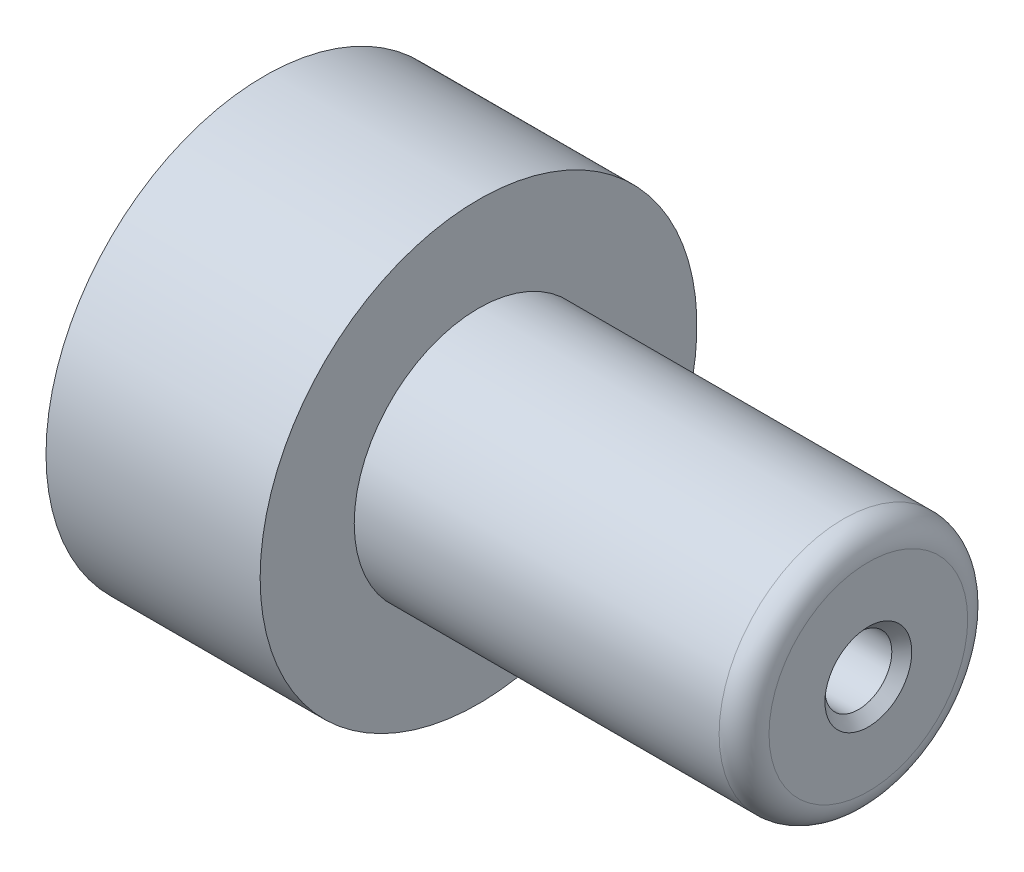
ISO-10303-21;
HEADER;
FILE_DESCRIPTION(('STEP AP214'),'2;1');
FILE_NAME('part.step','',(''),(''),'','','');
FILE_SCHEMA(('AUTOMOTIVE_DESIGN { 1 0 10303 214 1 1 1 1 }'));
ENDSEC;
DATA;
#1=APPLICATION_CONTEXT('core data for automotive mechanical design processes');
#2=APPLICATION_PROTOCOL_DEFINITION('international standard','automotive_design',2000,#1);
#3=PRODUCT_CONTEXT('',#1,'mechanical');
#4=PRODUCT('Part','Part','',(#3));
#5=PRODUCT_RELATED_PRODUCT_CATEGORY('part','',(#4));
#6=PRODUCT_DEFINITION_FORMATION('','',#4);
#7=PRODUCT_DEFINITION_CONTEXT('part definition',#1,'design');
#8=PRODUCT_DEFINITION('design','',#6,#7);
#9=PRODUCT_DEFINITION_SHAPE('','',#8);
#10=(LENGTH_UNIT() NAMED_UNIT(*) SI_UNIT(.MILLI.,.METRE.));
#11=(NAMED_UNIT(*) PLANE_ANGLE_UNIT() SI_UNIT($,.RADIAN.));
#12=(NAMED_UNIT(*) SI_UNIT($,.STERADIAN.) SOLID_ANGLE_UNIT());
#13=UNCERTAINTY_MEASURE_WITH_UNIT(LENGTH_MEASURE(1.E-05),#10,'distance_accuracy_value','');
#14=(GEOMETRIC_REPRESENTATION_CONTEXT(3) GLOBAL_UNCERTAINTY_ASSIGNED_CONTEXT((#13)) GLOBAL_UNIT_ASSIGNED_CONTEXT((#10,
#11,#12)) REPRESENTATION_CONTEXT('',''));
#15=CARTESIAN_POINT('',(0.,0.,0.));
#16=DIRECTION('',(0.,0.,1.));
#17=DIRECTION('',(1.,0.,0.));
#18=AXIS2_PLACEMENT_3D('',#15,#16,#17);
#19=CARTESIAN_POINT('',(0.,0.,0.));
#20=DIRECTION('',(-1.,0.,0.));
#21=DIRECTION('',(0.,0.,1.));
#22=AXIS2_PLACEMENT_3D('',#19,#20,#21);
#23=CYLINDRICAL_SURFACE('',#22,3.9751);
#24=CARTESIAN_POINT('',(21.8948,0.,0.));
#25=DIRECTION('',(-1.,0.,0.));
#26=DIRECTION('',(0.,0.,1.));
#27=AXIS2_PLACEMENT_3D('',#24,#25,#26);
#28=CIRCLE('',#27,3.9751);
#29=CARTESIAN_POINT('',(21.8948,0.,3.9751));
#30=VERTEX_POINT('',#29);
#31=EDGE_CURVE('E44',#30,#30,#28,.T.);
#32=ORIENTED_EDGE('',*,*,#31,.F.);
#33=EDGE_LOOP('',(#32));
#34=FACE_BOUND('',#33,.T.);
#35=CARTESIAN_POINT('',(0.,0.,0.));
#36=DIRECTION('',(-1.,0.,0.));
#37=DIRECTION('',(0.,0.,1.));
#38=AXIS2_PLACEMENT_3D('',#35,#36,#37);
#39=CIRCLE('',#38,3.9751);
#40=CARTESIAN_POINT('',(0.,0.,3.9751));
#41=VERTEX_POINT('',#40);
#42=EDGE_CURVE('E65',#41,#41,#39,.T.);
#43=ORIENTED_EDGE('',*,*,#42,.T.);
#44=EDGE_LOOP('',(#43));
#45=FACE_BOUND('',#44,.T.);
#46=ADVANCED_FACE('F33',(#34,#45),#23,.F.);
#47=CARTESIAN_POINT('',(21.8948,3.9751,0.));
#48=DIRECTION('',(1.,0.,0.));
#49=DIRECTION('',(0.,0.,-1.));
#50=AXIS2_PLACEMENT_3D('',#47,#48,#49);
#51=PLANE('',#50);
#52=CARTESIAN_POINT('',(21.8948,0.,0.));
#53=DIRECTION('',(1.,0.,0.));
#54=DIRECTION('',(0.,0.,-1.));
#55=AXIS2_PLACEMENT_3D('',#52,#53,#54);
#56=CIRCLE('',#55,1.7018);
#57=CARTESIAN_POINT('',(21.8948,0.,-1.7018));
#58=VERTEX_POINT('',#57);
#59=EDGE_CURVE('E78',#58,#58,#56,.T.);
#60=ORIENTED_EDGE('',*,*,#59,.T.);
#61=EDGE_LOOP('',(#60));
#62=FACE_BOUND('',#61,.T.);
#63=ORIENTED_EDGE('',*,*,#31,.T.);
#64=EDGE_LOOP('',(#63));
#65=FACE_BOUND('',#64,.T.);
#66=ADVANCED_FACE('F84',(#62,#65),#51,.F.);
#67=CARTESIAN_POINT('',(30.734,5.0546,0.));
#68=DIRECTION('',(-1.,0.,0.));
#69=DIRECTION('',(0.,0.,1.));
#70=AXIS2_PLACEMENT_3D('',#67,#68,#69);
#71=PLANE('',#70);
#72=CARTESIAN_POINT('',(30.734,0.,0.));
#73=DIRECTION('',(-1.,0.,0.));
#74=DIRECTION('',(0.,0.,1.));
#75=AXIS2_PLACEMENT_3D('',#72,#73,#74);
#76=CIRCLE('',#75,2.2098);
#77=CARTESIAN_POINT('',(30.734,0.,2.2098));
#78=VERTEX_POINT('',#77);
#79=EDGE_CURVE('E10',#78,#78,#76,.T.);
#80=ORIENTED_EDGE('',*,*,#79,.T.);
#81=EDGE_LOOP('',(#80));
#82=FACE_BOUND('',#81,.T.);
#83=CARTESIAN_POINT('',(30.734,0.,0.));
#84=DIRECTION('',(-1.,0.,0.));
#85=DIRECTION('',(0.,0.,1.));
#86=AXIS2_PLACEMENT_3D('',#83,#84,#85);
#87=CIRCLE('',#86,5.0546);
#88=CARTESIAN_POINT('',(30.734,0.,5.0546));
#89=VERTEX_POINT('',#88);
#90=EDGE_CURVE('E48',#89,#89,#87,.T.);
#91=ORIENTED_EDGE('',*,*,#90,.F.);
#92=EDGE_LOOP('',(#91));
#93=FACE_BOUND('',#92,.T.);
#94=ADVANCED_FACE('F104',(#82,#93),#71,.F.);
#95=CARTESIAN_POINT('',(29.464,0.,0.));
#96=DIRECTION('',(-1.,0.,0.));
#97=DIRECTION('',(0.,0.,1.));
#98=AXIS2_PLACEMENT_3D('',#95,#96,#97);
#99=TOROIDAL_SURFACE('',#98,5.0546,1.27);
#100=CARTESIAN_POINT('',(29.464,0.,0.));
#101=DIRECTION('',(-1.,0.,0.));
#102=DIRECTION('',(0.,0.,1.));
#103=AXIS2_PLACEMENT_3D('',#100,#101,#102);
#104=CIRCLE('',#103,6.3246);
#105=CARTESIAN_POINT('',(29.464,0.,6.3246));
#106=VERTEX_POINT('',#105);
#107=EDGE_CURVE('E53',#106,#106,#104,.T.);
#108=ORIENTED_EDGE('',*,*,#107,.F.);
#109=EDGE_LOOP('',(#108));
#110=FACE_BOUND('',#109,.T.);
#111=ORIENTED_EDGE('',*,*,#90,.T.);
#112=EDGE_LOOP('',(#111));
#113=FACE_BOUND('',#112,.T.);
#114=ADVANCED_FACE('F111',(#110,#113),#99,.T.);
#115=CARTESIAN_POINT('',(0.,0.,0.));
#116=DIRECTION('',(-1.,0.,0.));
#117=DIRECTION('',(0.,0.,1.));
#118=AXIS2_PLACEMENT_3D('',#115,#116,#117);
#119=CYLINDRICAL_SURFACE('',#118,6.3246);
#120=CARTESIAN_POINT('',(10.8966,0.,0.));
#121=DIRECTION('',(-1.,0.,0.));
#122=DIRECTION('',(0.,0.,1.));
#123=AXIS2_PLACEMENT_3D('',#120,#121,#122);
#124=CIRCLE('',#123,6.3246);
#125=CARTESIAN_POINT('',(10.8966,0.,6.3246));
#126=VERTEX_POINT('',#125);
#127=EDGE_CURVE('E56',#126,#126,#124,.T.);
#128=ORIENTED_EDGE('',*,*,#127,.F.);
#129=EDGE_LOOP('',(#128));
#130=FACE_BOUND('',#129,.T.);
#131=ORIENTED_EDGE('',*,*,#107,.T.);
#132=EDGE_LOOP('',(#131));
#133=FACE_BOUND('',#132,.T.);
#134=ADVANCED_FACE('F114',(#130,#133),#119,.T.);
#135=CARTESIAN_POINT('',(10.8966,11.1125,0.));
#136=DIRECTION('',(-1.,0.,0.));
#137=DIRECTION('',(0.,0.,1.));
#138=AXIS2_PLACEMENT_3D('',#135,#136,#137);
#139=PLANE('',#138);
#140=CARTESIAN_POINT('',(10.8966,0.,0.));
#141=DIRECTION('',(-1.,0.,0.));
#142=DIRECTION('',(0.,0.,1.));
#143=AXIS2_PLACEMENT_3D('',#140,#141,#142);
#144=CIRCLE('',#143,11.1125);
#145=CARTESIAN_POINT('',(10.8966,0.,11.1125));
#146=VERTEX_POINT('',#145);
#147=EDGE_CURVE('E59',#146,#146,#144,.T.);
#148=ORIENTED_EDGE('',*,*,#147,.F.);
#149=EDGE_LOOP('',(#148));
#150=FACE_BOUND('',#149,.T.);
#151=ORIENTED_EDGE('',*,*,#127,.T.);
#152=EDGE_LOOP('',(#151));
#153=FACE_BOUND('',#152,.T.);
#154=ADVANCED_FACE('F118',(#150,#153),#139,.F.);
#155=CARTESIAN_POINT('',(0.,0.,0.));
#156=DIRECTION('',(-1.,0.,0.));
#157=DIRECTION('',(0.,0.,1.));
#158=AXIS2_PLACEMENT_3D('',#155,#156,#157);
#159=CYLINDRICAL_SURFACE('',#158,11.1125);
#160=CARTESIAN_POINT('',(0.,0.,0.));
#161=DIRECTION('',(-1.,0.,0.));
#162=DIRECTION('',(0.,0.,1.));
#163=AXIS2_PLACEMENT_3D('',#160,#161,#162);
#164=CIRCLE('',#163,11.1125);
#165=CARTESIAN_POINT('',(0.,0.,11.1125));
#166=VERTEX_POINT('',#165);
#167=EDGE_CURVE('E62',#166,#166,#164,.T.);
#168=ORIENTED_EDGE('',*,*,#167,.F.);
#169=EDGE_LOOP('',(#168));
#170=FACE_BOUND('',#169,.T.);
#171=ORIENTED_EDGE('',*,*,#147,.T.);
#172=EDGE_LOOP('',(#171));
#173=FACE_BOUND('',#172,.T.);
#174=ADVANCED_FACE('F122',(#170,#173),#159,.T.);
#175=CARTESIAN_POINT('',(0.,3.9751,0.));
#176=DIRECTION('',(1.,0.,0.));
#177=DIRECTION('',(0.,0.,-1.));
#178=AXIS2_PLACEMENT_3D('',#175,#176,#177);
#179=PLANE('',#178);
#180=CARTESIAN_POINT('',(0.,0.,6.7437));
#181=DIRECTION('',(-1.,0.,0.));
#182=DIRECTION('',(0.,0.,-1.));
#183=AXIS2_PLACEMENT_3D('',#180,#181,#182);
#184=CIRCLE('',#183,1.2065);
#185=CARTESIAN_POINT('',(0.,0.,5.5372));
#186=VERTEX_POINT('',#185);
#187=EDGE_CURVE('E75',#186,#186,#184,.T.);
#188=ORIENTED_EDGE('',*,*,#187,.F.);
#189=EDGE_LOOP('',(#188));
#190=FACE_BOUND('',#189,.T.);
#191=CARTESIAN_POINT('',(0.,0.,-6.7437));
#192=DIRECTION('',(-1.,0.,0.));
#193=DIRECTION('',(0.,0.,1.));
#194=AXIS2_PLACEMENT_3D('',#191,#192,#193);
#195=CIRCLE('',#194,1.2065);
#196=CARTESIAN_POINT('',(0.,0.,-5.5372));
#197=VERTEX_POINT('',#196);
#198=EDGE_CURVE('E69',#197,#197,#195,.T.);
#199=ORIENTED_EDGE('',*,*,#198,.F.);
#200=EDGE_LOOP('',(#199));
#201=FACE_BOUND('',#200,.T.);
#202=ORIENTED_EDGE('',*,*,#42,.F.);
#203=EDGE_LOOP('',(#202));
#204=FACE_BOUND('',#203,.T.);
#205=ORIENTED_EDGE('',*,*,#167,.T.);
#206=EDGE_LOOP('',(#205));
#207=FACE_BOUND('',#206,.T.);
#208=ADVANCED_FACE('F126',(#190,#201,#204,#207),#179,.F.);
#209=CARTESIAN_POINT('',(2.54,0.,-6.7437));
#210=DIRECTION('',(-1.,0.,0.));
#211=DIRECTION('',(0.,0.,1.));
#212=AXIS2_PLACEMENT_3D('',#209,#210,#211);
#213=CYLINDRICAL_SURFACE('',#212,1.2065);
#214=CARTESIAN_POINT('',(2.54,0.,-6.7437));
#215=DIRECTION('',(-1.,0.,0.));
#216=DIRECTION('',(0.,0.,1.));
#217=AXIS2_PLACEMENT_3D('',#214,#215,#216);
#218=CIRCLE('',#217,1.2065);
#219=CARTESIAN_POINT('',(2.54,0.,-5.5372));
#220=VERTEX_POINT('',#219);
#221=EDGE_CURVE('E68',#220,#220,#218,.T.);
#222=ORIENTED_EDGE('',*,*,#221,.F.);
#223=EDGE_LOOP('',(#222));
#224=FACE_BOUND('',#223,.T.);
#225=ORIENTED_EDGE('',*,*,#198,.T.);
#226=EDGE_LOOP('',(#225));
#227=FACE_BOUND('',#226,.T.);
#228=ADVANCED_FACE('F130',(#224,#227),#213,.F.);
#229=CARTESIAN_POINT('',(2.54,0.,-6.7437));
#230=DIRECTION('',(-1.,0.,0.));
#231=DIRECTION('',(0.,0.,1.));
#232=AXIS2_PLACEMENT_3D('',#229,#230,#231);
#233=PLANE('',#232);
#234=ORIENTED_EDGE('',*,*,#221,.T.);
#235=EDGE_LOOP('',(#234));
#236=FACE_BOUND('',#235,.T.);
#237=ADVANCED_FACE('F134',(#236),#233,.T.);
#238=CARTESIAN_POINT('',(2.54,0.,6.7437));
#239=DIRECTION('',(-1.,0.,0.));
#240=DIRECTION('',(0.,0.,1.));
#241=AXIS2_PLACEMENT_3D('',#238,#239,#240);
#242=CYLINDRICAL_SURFACE('',#241,1.2065);
#243=CARTESIAN_POINT('',(2.54,0.,6.7437));
#244=DIRECTION('',(-1.,0.,0.));
#245=DIRECTION('',(0.,0.,-1.));
#246=AXIS2_PLACEMENT_3D('',#243,#244,#245);
#247=CIRCLE('',#246,1.2065);
#248=CARTESIAN_POINT('',(2.54,0.,5.5372));
#249=VERTEX_POINT('',#248);
#250=EDGE_CURVE('E72',#249,#249,#247,.T.);
#251=ORIENTED_EDGE('',*,*,#250,.F.);
#252=EDGE_LOOP('',(#251));
#253=FACE_BOUND('',#252,.T.);
#254=ORIENTED_EDGE('',*,*,#187,.T.);
#255=EDGE_LOOP('',(#254));
#256=FACE_BOUND('',#255,.T.);
#257=ADVANCED_FACE('F96',(#253,#256),#242,.F.);
#258=CARTESIAN_POINT('',(2.54,0.,6.7437));
#259=DIRECTION('',(1.,0.,0.));
#260=DIRECTION('',(0.,0.,-1.));
#261=AXIS2_PLACEMENT_3D('',#258,#259,#260);
#262=PLANE('',#261);
#263=ORIENTED_EDGE('',*,*,#250,.T.);
#264=EDGE_LOOP('',(#263));
#265=FACE_BOUND('',#264,.T.);
#266=ADVANCED_FACE('F89',(#265),#262,.F.);
#267=CARTESIAN_POINT('',(0.,0.,0.));
#268=DIRECTION('',(1.,0.,0.));
#269=DIRECTION('',(0.,0.,-1.));
#270=AXIS2_PLACEMENT_3D('',#267,#268,#269);
#271=CYLINDRICAL_SURFACE('',#270,1.7018);
#272=CARTESIAN_POINT('',(30.226,0.,0.));
#273=DIRECTION('',(-1.,0.,0.));
#274=DIRECTION('',(0.,0.,1.));
#275=AXIS2_PLACEMENT_3D('',#272,#273,#274);
#276=CIRCLE('',#275,1.7018);
#277=CARTESIAN_POINT('',(30.226,0.,1.7018));
#278=VERTEX_POINT('',#277);
#279=EDGE_CURVE('E40',#278,#278,#276,.F.);
#280=ORIENTED_EDGE('',*,*,#279,.T.);
#281=EDGE_LOOP('',(#280));
#282=FACE_BOUND('',#281,.T.);
#283=ORIENTED_EDGE('',*,*,#59,.F.);
#284=EDGE_LOOP('',(#283));
#285=FACE_BOUND('',#284,.T.);
#286=ADVANCED_FACE('F87',(#282,#285),#271,.F.);
#287=CARTESIAN_POINT('',(30.226,0.,0.));
#288=DIRECTION('',(1.,0.,0.));
#289=DIRECTION('',(0.,0.,-1.));
#290=AXIS2_PLACEMENT_3D('',#287,#288,#289);
#291=CONICAL_SURFACE('',#290,1.7018,0.785398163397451);
#292=ORIENTED_EDGE('',*,*,#79,.F.);
#293=EDGE_LOOP('',(#292));
#294=FACE_BOUND('',#293,.T.);
#295=ORIENTED_EDGE('',*,*,#279,.F.);
#296=EDGE_LOOP('',(#295));
#297=FACE_BOUND('',#296,.T.);
#298=ADVANCED_FACE('F35',(#294,#297),#291,.F.);
#299=CLOSED_SHELL('',(#46,#66,#94,#114,#134,#154,#174,#208,#228,#237,#257,#266,#286,#298));
#300=MANIFOLD_SOLID_BREP('B2',#299);
#301=ADVANCED_BREP_SHAPE_REPRESENTATION('',(#18,#300),#14);
#302=SHAPE_DEFINITION_REPRESENTATION(#9,#301);
ENDSEC;
END-ISO-10303-21;
